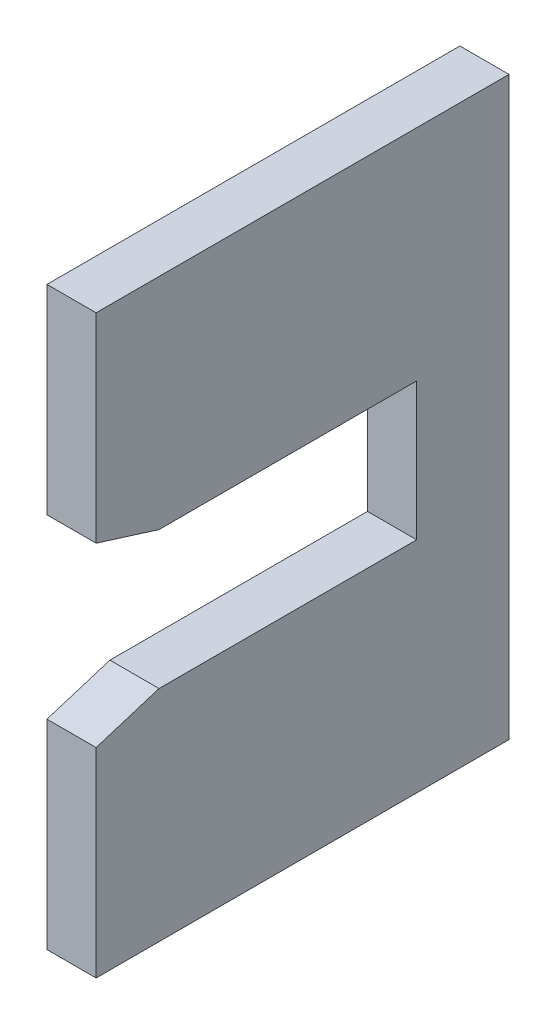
ISO-10303-21;
HEADER;
FILE_DESCRIPTION(('STEP AP214'),'2;1');
FILE_NAME('part.step','',(''),(''),'','','');
FILE_SCHEMA(('AUTOMOTIVE_DESIGN { 1 0 10303 214 1 1 1 1 }'));
ENDSEC;
DATA;
#1=APPLICATION_CONTEXT('core data for automotive mechanical design processes');
#2=APPLICATION_PROTOCOL_DEFINITION('international standard','automotive_design',2000,#1);
#3=PRODUCT_CONTEXT('',#1,'mechanical');
#4=PRODUCT('Part','Part','',(#3));
#5=PRODUCT_RELATED_PRODUCT_CATEGORY('part','',(#4));
#6=PRODUCT_DEFINITION_FORMATION('','',#4);
#7=PRODUCT_DEFINITION_CONTEXT('part definition',#1,'design');
#8=PRODUCT_DEFINITION('design','',#6,#7);
#9=PRODUCT_DEFINITION_SHAPE('','',#8);
#10=(LENGTH_UNIT() NAMED_UNIT(*) SI_UNIT(.MILLI.,.METRE.));
#11=(NAMED_UNIT(*) PLANE_ANGLE_UNIT() SI_UNIT($,.RADIAN.));
#12=(NAMED_UNIT(*) SI_UNIT($,.STERADIAN.) SOLID_ANGLE_UNIT());
#13=UNCERTAINTY_MEASURE_WITH_UNIT(LENGTH_MEASURE(1.E-05),#10,'distance_accuracy_value','');
#14=(GEOMETRIC_REPRESENTATION_CONTEXT(3) GLOBAL_UNCERTAINTY_ASSIGNED_CONTEXT((#13)) GLOBAL_UNIT_ASSIGNED_CONTEXT((#10,
#11,#12)) REPRESENTATION_CONTEXT('',''));
#15=CARTESIAN_POINT('',(0.,0.,0.));
#16=DIRECTION('',(0.,0.,1.));
#17=DIRECTION('',(1.,0.,0.));
#18=AXIS2_PLACEMENT_3D('',#15,#16,#17);
#19=CARTESIAN_POINT('',(16.8121336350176,-35.8586288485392,21.));
#20=DIRECTION('',(0.,0.,-1.));
#21=DIRECTION('',(-1.,0.,0.));
#22=AXIS2_PLACEMENT_3D('',#19,#20,#21);
#23=PLANE('',#22);
#24=DIRECTION('',(0.,1.,0.));
#25=VECTOR('',#24,1.);
#26=CARTESIAN_POINT('',(16.8121336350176,-6.55862884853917,21.));
#27=LINE('',#26,#25);
#28=CARTESIAN_POINT('',(16.8121336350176,-35.8586288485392,21.));
#29=VERTEX_POINT('',#28);
#30=CARTESIAN_POINT('',(16.8121336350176,-25.7086288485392,21.));
#31=VERTEX_POINT('',#30);
#32=EDGE_CURVE('E164',#29,#31,#27,.T.);
#33=ORIENTED_EDGE('',*,*,#32,.T.);
#34=DIRECTION('',(1.,0.,0.));
#35=VECTOR('',#34,1.);
#36=CARTESIAN_POINT('',(14.3121336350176,-25.7086288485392,21.));
#37=LINE('',#36,#35);
#38=CARTESIAN_POINT('',(14.3121336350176,-25.7086288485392,21.));
#39=VERTEX_POINT('',#38);
#40=EDGE_CURVE('E121',#39,#31,#37,.T.);
#41=ORIENTED_EDGE('',*,*,#40,.F.);
#42=DIRECTION('',(0.,-1.,0.));
#43=VECTOR('',#42,1.);
#44=CARTESIAN_POINT('',(14.3121336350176,-6.55862884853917,21.));
#45=LINE('',#44,#43);
#46=CARTESIAN_POINT('',(14.3121336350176,-35.8586288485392,21.));
#47=VERTEX_POINT('',#46);
#48=EDGE_CURVE('E168',#39,#47,#45,.T.);
#49=ORIENTED_EDGE('',*,*,#48,.T.);
#50=DIRECTION('',(1.,0.,0.));
#51=VECTOR('',#50,1.);
#52=CARTESIAN_POINT('',(16.8121336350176,-35.8586288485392,21.));
#53=LINE('',#52,#51);
#54=EDGE_CURVE('E49',#47,#29,#53,.T.);
#55=ORIENTED_EDGE('',*,*,#54,.T.);
#56=EDGE_LOOP('',(#33,#41,#49,#55));
#57=FACE_BOUND('',#56,.T.);
#58=ADVANCED_FACE('F26',(#57),#23,.F.);
#59=CARTESIAN_POINT('',(16.8121336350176,-6.55862884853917,21.));
#60=DIRECTION('',(-1.,0.,0.));
#61=DIRECTION('',(0.,0.,1.));
#62=AXIS2_PLACEMENT_3D('',#59,#60,#61);
#63=PLANE('',#62);
#64=DIRECTION('',(0.,0.,-1.));
#65=VECTOR('',#64,1.);
#66=CARTESIAN_POINT('',(16.8121336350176,-24.7086288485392,17.8));
#67=LINE('',#66,#65);
#68=CARTESIAN_POINT('',(16.8121336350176,-24.7086288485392,17.8));
#69=VERTEX_POINT('',#68);
#70=CARTESIAN_POINT('',(16.8121336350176,-24.7086288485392,4.69733906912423));
#71=VERTEX_POINT('',#70);
#72=EDGE_CURVE('E108',#69,#71,#67,.T.);
#73=ORIENTED_EDGE('',*,*,#72,.F.);
#74=DIRECTION('',(0.,0.298274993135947,-0.95447997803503));
#75=VECTOR('',#74,1.);
#76=CARTESIAN_POINT('',(16.8121336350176,-25.7086288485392,21.));
#77=LINE('',#76,#75);
#78=EDGE_CURVE('E118',#31,#69,#77,.T.);
#79=ORIENTED_EDGE('',*,*,#78,.F.);
#80=ORIENTED_EDGE('',*,*,#32,.F.);
#81=DIRECTION('',(0.,0.,-1.));
#82=VECTOR('',#81,1.);
#83=CARTESIAN_POINT('',(16.8121336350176,-35.8586288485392,21.));
#84=LINE('',#83,#82);
#85=CARTESIAN_POINT('',(16.8121336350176,-35.8586288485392,0.));
#86=VERTEX_POINT('',#85);
#87=EDGE_CURVE('E173',#29,#86,#84,.T.);
#88=ORIENTED_EDGE('',*,*,#87,.T.);
#89=DIRECTION('',(0.,1.,0.));
#90=VECTOR('',#89,1.);
#91=CARTESIAN_POINT('',(16.8121336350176,-6.55862884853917,0.));
#92=LINE('',#91,#90);
#93=CARTESIAN_POINT('',(16.8121336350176,-6.55862884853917,0.));
#94=VERTEX_POINT('',#93);
#95=EDGE_CURVE('E147',#86,#94,#92,.T.);
#96=ORIENTED_EDGE('',*,*,#95,.T.);
#97=DIRECTION('',(0.,0.,-1.));
#98=VECTOR('',#97,1.);
#99=CARTESIAN_POINT('',(16.8121336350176,-6.55862884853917,21.));
#100=LINE('',#99,#98);
#101=CARTESIAN_POINT('',(16.8121336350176,-6.55862884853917,21.));
#102=VERTEX_POINT('',#101);
#103=EDGE_CURVE('E11',#102,#94,#100,.T.);
#104=ORIENTED_EDGE('',*,*,#103,.F.);
#105=CARTESIAN_POINT('',(16.8121336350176,-16.7086288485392,21.));
#106=VERTEX_POINT('',#105);
#107=EDGE_CURVE('E163',#106,#102,#27,.T.);
#108=ORIENTED_EDGE('',*,*,#107,.F.);
#109=DIRECTION('',(0.,0.298274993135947,0.95447997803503));
#110=VECTOR('',#109,1.);
#111=CARTESIAN_POINT('',(16.8121336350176,-16.7086288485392,21.));
#112=LINE('',#111,#110);
#113=CARTESIAN_POINT('',(16.8121336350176,-17.7086288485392,17.8));
#114=VERTEX_POINT('',#113);
#115=EDGE_CURVE('E41',#114,#106,#112,.T.);
#116=ORIENTED_EDGE('',*,*,#115,.F.);
#117=DIRECTION('',(0.,0.,1.));
#118=VECTOR('',#117,1.);
#119=CARTESIAN_POINT('',(16.8121336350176,-17.7086288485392,17.8));
#120=LINE('',#119,#118);
#121=CARTESIAN_POINT('',(16.8121336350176,-17.7086288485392,4.69733906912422));
#122=VERTEX_POINT('',#121);
#123=EDGE_CURVE('E129',#122,#114,#120,.T.);
#124=ORIENTED_EDGE('',*,*,#123,.F.);
#125=DIRECTION('',(0.,1.,0.));
#126=VECTOR('',#125,1.);
#127=CARTESIAN_POINT('',(16.8121336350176,-17.7086288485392,4.69733906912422));
#128=LINE('',#127,#126);
#129=EDGE_CURVE('E127',#71,#122,#128,.T.);
#130=ORIENTED_EDGE('',*,*,#129,.F.);
#131=EDGE_LOOP('',(#73,#79,#80,#88,#96,#104,#108,#116,#124,#130));
#132=FACE_BOUND('',#131,.T.);
#133=ADVANCED_FACE('F28',(#132),#63,.F.);
#134=CARTESIAN_POINT('',(16.8121336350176,-6.55862884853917,21.));
#135=DIRECTION('',(0.,-1.,0.));
#136=DIRECTION('',(1.,0.,0.));
#137=AXIS2_PLACEMENT_3D('',#134,#135,#136);
#138=PLANE('',#137);
#139=DIRECTION('',(-1.,0.,0.));
#140=VECTOR('',#139,1.);
#141=CARTESIAN_POINT('',(16.8121336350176,-6.55862884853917,0.));
#142=LINE('',#141,#140);
#143=CARTESIAN_POINT('',(14.3121336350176,-6.55862884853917,0.));
#144=VERTEX_POINT('',#143);
#145=EDGE_CURVE('E157',#94,#144,#142,.T.);
#146=ORIENTED_EDGE('',*,*,#145,.T.);
#147=DIRECTION('',(0.,0.,-1.));
#148=VECTOR('',#147,1.);
#149=CARTESIAN_POINT('',(14.3121336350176,-6.55862884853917,21.));
#150=LINE('',#149,#148);
#151=CARTESIAN_POINT('',(14.3121336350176,-6.55862884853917,21.));
#152=VERTEX_POINT('',#151);
#153=EDGE_CURVE('E34',#152,#144,#150,.T.);
#154=ORIENTED_EDGE('',*,*,#153,.F.);
#155=DIRECTION('',(-1.,0.,0.));
#156=VECTOR('',#155,1.);
#157=CARTESIAN_POINT('',(16.8121336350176,-6.55862884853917,21.));
#158=LINE('',#157,#156);
#159=EDGE_CURVE('E166',#102,#152,#158,.T.);
#160=ORIENTED_EDGE('',*,*,#159,.F.);
#161=ORIENTED_EDGE('',*,*,#103,.T.);
#162=EDGE_LOOP('',(#146,#154,#160,#161));
#163=FACE_BOUND('',#162,.T.);
#164=ADVANCED_FACE('F206',(#163),#138,.F.);
#165=CARTESIAN_POINT('',(14.3121336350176,-6.55862884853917,21.));
#166=DIRECTION('',(1.,0.,0.));
#167=DIRECTION('',(0.,0.,-1.));
#168=AXIS2_PLACEMENT_3D('',#165,#166,#167);
#169=PLANE('',#168);
#170=ORIENTED_EDGE('',*,*,#48,.F.);
#171=DIRECTION('',(0.,0.298274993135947,-0.95447997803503));
#172=VECTOR('',#171,1.);
#173=CARTESIAN_POINT('',(14.3121336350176,-25.7086288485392,21.));
#174=LINE('',#173,#172);
#175=CARTESIAN_POINT('',(14.3121336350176,-24.7086288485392,17.8));
#176=VERTEX_POINT('',#175);
#177=EDGE_CURVE('E135',#39,#176,#174,.T.);
#178=ORIENTED_EDGE('',*,*,#177,.T.);
#179=DIRECTION('',(0.,0.,-1.));
#180=VECTOR('',#179,1.);
#181=CARTESIAN_POINT('',(14.3121336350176,-24.7086288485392,17.8));
#182=LINE('',#181,#180);
#183=CARTESIAN_POINT('',(14.3121336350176,-24.7086288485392,4.69733906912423));
#184=VERTEX_POINT('',#183);
#185=EDGE_CURVE('E111',#176,#184,#182,.T.);
#186=ORIENTED_EDGE('',*,*,#185,.T.);
#187=DIRECTION('',(0.,1.,0.));
#188=VECTOR('',#187,1.);
#189=CARTESIAN_POINT('',(14.3121336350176,-17.7086288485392,4.69733906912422));
#190=LINE('',#189,#188);
#191=CARTESIAN_POINT('',(14.3121336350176,-17.7086288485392,4.69733906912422));
#192=VERTEX_POINT('',#191);
#193=EDGE_CURVE('E138',#184,#192,#190,.T.);
#194=ORIENTED_EDGE('',*,*,#193,.T.);
#195=DIRECTION('',(0.,0.,1.));
#196=VECTOR('',#195,1.);
#197=CARTESIAN_POINT('',(14.3121336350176,-17.7086288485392,17.8));
#198=LINE('',#197,#196);
#199=CARTESIAN_POINT('',(14.3121336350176,-17.7086288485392,17.8));
#200=VERTEX_POINT('',#199);
#201=EDGE_CURVE('E141',#192,#200,#198,.T.);
#202=ORIENTED_EDGE('',*,*,#201,.T.);
#203=DIRECTION('',(0.,0.298274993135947,0.95447997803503));
#204=VECTOR('',#203,1.);
#205=CARTESIAN_POINT('',(14.3121336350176,-16.7086288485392,21.));
#206=LINE('',#205,#204);
#207=CARTESIAN_POINT('',(14.3121336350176,-16.7086288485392,21.));
#208=VERTEX_POINT('',#207);
#209=EDGE_CURVE('E115',#200,#208,#206,.T.);
#210=ORIENTED_EDGE('',*,*,#209,.T.);
#211=EDGE_CURVE('E169',#152,#208,#45,.T.);
#212=ORIENTED_EDGE('',*,*,#211,.F.);
#213=ORIENTED_EDGE('',*,*,#153,.T.);
#214=DIRECTION('',(0.,-1.,0.));
#215=VECTOR('',#214,1.);
#216=CARTESIAN_POINT('',(14.3121336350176,-6.55862884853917,0.));
#217=LINE('',#216,#215);
#218=CARTESIAN_POINT('',(14.3121336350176,-35.8586288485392,0.));
#219=VERTEX_POINT('',#218);
#220=EDGE_CURVE('E159',#144,#219,#217,.T.);
#221=ORIENTED_EDGE('',*,*,#220,.T.);
#222=DIRECTION('',(0.,0.,-1.));
#223=VECTOR('',#222,1.);
#224=CARTESIAN_POINT('',(14.3121336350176,-35.8586288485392,21.));
#225=LINE('',#224,#223);
#226=EDGE_CURVE('E176',#47,#219,#225,.T.);
#227=ORIENTED_EDGE('',*,*,#226,.F.);
#228=EDGE_LOOP('',(#170,#178,#186,#194,#202,#210,#212,#213,#221,#227));
#229=FACE_BOUND('',#228,.T.);
#230=ADVANCED_FACE('F184',(#229),#169,.F.);
#231=CARTESIAN_POINT('',(16.8121336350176,-35.8586288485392,21.));
#232=DIRECTION('',(0.,1.,0.));
#233=DIRECTION('',(0.,0.,1.));
#234=AXIS2_PLACEMENT_3D('',#231,#232,#233);
#235=PLANE('',#234);
#236=DIRECTION('',(1.,0.,0.));
#237=VECTOR('',#236,1.);
#238=CARTESIAN_POINT('',(16.8121336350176,-35.8586288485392,0.));
#239=LINE('',#238,#237);
#240=EDGE_CURVE('E161',#219,#86,#239,.T.);
#241=ORIENTED_EDGE('',*,*,#240,.T.);
#242=ORIENTED_EDGE('',*,*,#87,.F.);
#243=ORIENTED_EDGE('',*,*,#54,.F.);
#244=ORIENTED_EDGE('',*,*,#226,.T.);
#245=EDGE_LOOP('',(#241,#242,#243,#244));
#246=FACE_BOUND('',#245,.T.);
#247=ADVANCED_FACE('F193',(#246),#235,.F.);
#248=ORIENTED_EDGE('',*,*,#211,.T.);
#249=DIRECTION('',(1.,0.,0.));
#250=VECTOR('',#249,1.);
#251=CARTESIAN_POINT('',(14.3121336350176,-16.7086288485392,21.));
#252=LINE('',#251,#250);
#253=EDGE_CURVE('E148',#208,#106,#252,.T.);
#254=ORIENTED_EDGE('',*,*,#253,.T.);
#255=ORIENTED_EDGE('',*,*,#107,.T.);
#256=ORIENTED_EDGE('',*,*,#159,.T.);
#257=EDGE_LOOP('',(#248,#254,#255,#256));
#258=FACE_BOUND('',#257,.T.);
#259=ADVANCED_FACE('F204',(#258),#23,.F.);
#260=CARTESIAN_POINT('',(16.8121336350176,-35.8586288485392,0.));
#261=DIRECTION('',(0.,0.,-1.));
#262=DIRECTION('',(-1.,0.,0.));
#263=AXIS2_PLACEMENT_3D('',#260,#261,#262);
#264=PLANE('',#263);
#265=ORIENTED_EDGE('',*,*,#95,.F.);
#266=ORIENTED_EDGE('',*,*,#240,.F.);
#267=ORIENTED_EDGE('',*,*,#220,.F.);
#268=ORIENTED_EDGE('',*,*,#145,.F.);
#269=EDGE_LOOP('',(#265,#266,#267,#268));
#270=FACE_BOUND('',#269,.T.);
#271=ADVANCED_FACE('F191',(#270),#264,.T.);
#272=CARTESIAN_POINT('',(14.3121336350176,-25.7086288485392,21.));
#273=DIRECTION('',(0.,-0.95447997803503,-0.298274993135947));
#274=DIRECTION('',(0.,0.298274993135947,-0.95447997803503));
#275=AXIS2_PLACEMENT_3D('',#272,#273,#274);
#276=PLANE('',#275);
#277=ORIENTED_EDGE('',*,*,#78,.T.);
#278=DIRECTION('',(1.,0.,0.));
#279=VECTOR('',#278,1.);
#280=CARTESIAN_POINT('',(14.3121336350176,-24.7086288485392,17.8));
#281=LINE('',#280,#279);
#282=EDGE_CURVE('E104',#176,#69,#281,.T.);
#283=ORIENTED_EDGE('',*,*,#282,.F.);
#284=ORIENTED_EDGE('',*,*,#177,.F.);
#285=ORIENTED_EDGE('',*,*,#40,.T.);
#286=EDGE_LOOP('',(#277,#283,#284,#285));
#287=FACE_BOUND('',#286,.T.);
#288=ADVANCED_FACE('F119',(#287),#276,.F.);
#289=CARTESIAN_POINT('',(14.3121336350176,-16.7086288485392,21.));
#290=DIRECTION('',(0.,0.95447997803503,-0.298274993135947));
#291=DIRECTION('',(0.,0.298274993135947,0.95447997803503));
#292=AXIS2_PLACEMENT_3D('',#289,#290,#291);
#293=PLANE('',#292);
#294=ORIENTED_EDGE('',*,*,#115,.T.);
#295=ORIENTED_EDGE('',*,*,#253,.F.);
#296=ORIENTED_EDGE('',*,*,#209,.F.);
#297=DIRECTION('',(1.,0.,0.));
#298=VECTOR('',#297,1.);
#299=CARTESIAN_POINT('',(14.3121336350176,-17.7086288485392,17.8));
#300=LINE('',#299,#298);
#301=EDGE_CURVE('E150',#200,#114,#300,.T.);
#302=ORIENTED_EDGE('',*,*,#301,.T.);
#303=EDGE_LOOP('',(#294,#295,#296,#302));
#304=FACE_BOUND('',#303,.T.);
#305=ADVANCED_FACE('F202',(#304),#293,.F.);
#306=CARTESIAN_POINT('',(14.3121336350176,-17.7086288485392,17.8));
#307=DIRECTION('',(0.,1.,0.));
#308=DIRECTION('',(0.,0.,1.));
#309=AXIS2_PLACEMENT_3D('',#306,#307,#308);
#310=PLANE('',#309);
#311=ORIENTED_EDGE('',*,*,#123,.T.);
#312=ORIENTED_EDGE('',*,*,#301,.F.);
#313=ORIENTED_EDGE('',*,*,#201,.F.);
#314=DIRECTION('',(1.,0.,0.));
#315=VECTOR('',#314,1.);
#316=CARTESIAN_POINT('',(14.3121336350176,-17.7086288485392,4.69733906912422));
#317=LINE('',#316,#315);
#318=EDGE_CURVE('E152',#192,#122,#317,.T.);
#319=ORIENTED_EDGE('',*,*,#318,.T.);
#320=EDGE_LOOP('',(#311,#312,#313,#319));
#321=FACE_BOUND('',#320,.T.);
#322=ADVANCED_FACE('F200',(#321),#310,.F.);
#323=CARTESIAN_POINT('',(14.3121336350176,-17.7086288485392,4.69733906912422));
#324=DIRECTION('',(0.,0.,-1.));
#325=DIRECTION('',(0.,1.,0.));
#326=AXIS2_PLACEMENT_3D('',#323,#324,#325);
#327=PLANE('',#326);
#328=ORIENTED_EDGE('',*,*,#129,.T.);
#329=ORIENTED_EDGE('',*,*,#318,.F.);
#330=ORIENTED_EDGE('',*,*,#193,.F.);
#331=DIRECTION('',(1.,0.,0.));
#332=VECTOR('',#331,1.);
#333=CARTESIAN_POINT('',(14.3121336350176,-24.7086288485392,4.69733906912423));
#334=LINE('',#333,#332);
#335=EDGE_CURVE('E114',#184,#71,#334,.T.);
#336=ORIENTED_EDGE('',*,*,#335,.T.);
#337=EDGE_LOOP('',(#328,#329,#330,#336));
#338=FACE_BOUND('',#337,.T.);
#339=ADVANCED_FACE('F198',(#338),#327,.F.);
#340=CARTESIAN_POINT('',(14.3121336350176,-24.7086288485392,17.8));
#341=DIRECTION('',(0.,-1.,0.));
#342=DIRECTION('',(0.,0.,-1.));
#343=AXIS2_PLACEMENT_3D('',#340,#341,#342);
#344=PLANE('',#343);
#345=ORIENTED_EDGE('',*,*,#72,.T.);
#346=ORIENTED_EDGE('',*,*,#335,.F.);
#347=ORIENTED_EDGE('',*,*,#185,.F.);
#348=ORIENTED_EDGE('',*,*,#282,.T.);
#349=EDGE_LOOP('',(#345,#346,#347,#348));
#350=FACE_BOUND('',#349,.T.);
#351=ADVANCED_FACE('F106',(#350),#344,.F.);
#352=CLOSED_SHELL('',(#58,#133,#164,#230,#247,#259,#271,#288,#305,#322,#339,#351));
#353=MANIFOLD_SOLID_BREP('B2',#352);
#354=ADVANCED_BREP_SHAPE_REPRESENTATION('',(#18,#353),#14);
#355=SHAPE_DEFINITION_REPRESENTATION(#9,#354);
ENDSEC;
END-ISO-10303-21;
